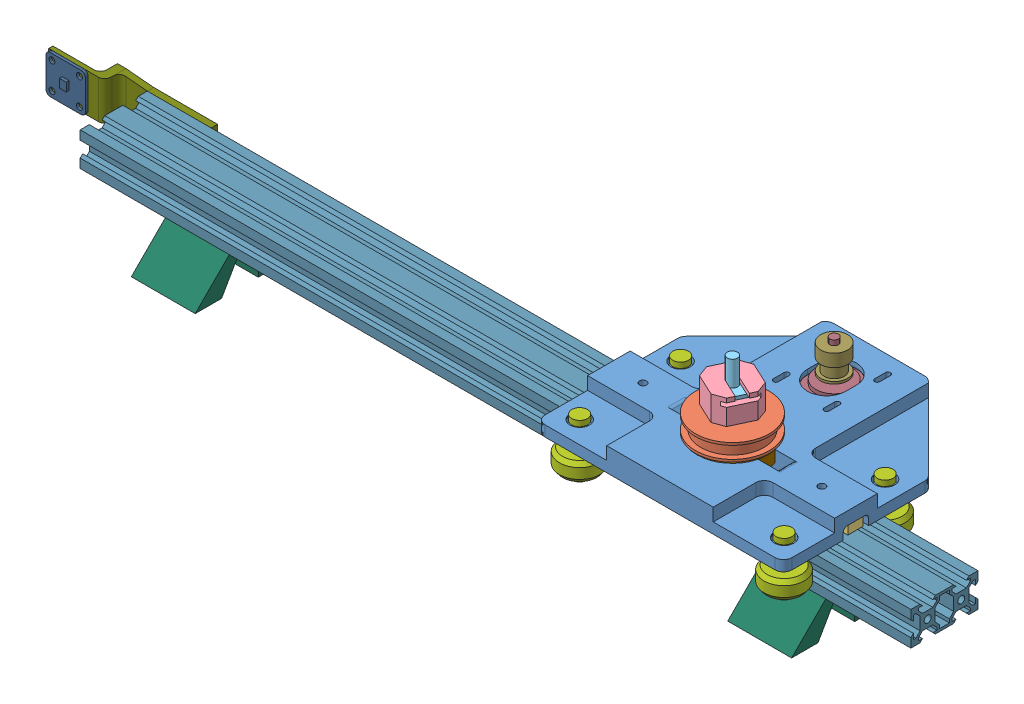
SolidWorks assembly Total Assembly.SLDASM, configuration Default (file format 15000). Lengths in mm.
Overall size (545.21 98.42 134.95).
24 component instances, 16 part files, 12 mates.
Components (placement in the parent):
- Camera Mount Assembly-1: Camera Mount Assembly.SLDASM [Default] at (442.5309 13.081 -43.18) x (-1 0 0) z (0 0 -1) size (155.86 84.23 134.95)
  - Camera Adapter w Bearings-1: Camera Adapter w Bearings.SLDPRT [Default] at origin size (147.32 13.97 130.81)
  - Big Pully-1: Big Pully.SLDPRT [Default] at (73.66 25.4 -43.18) x (-0.462019 0 -0.88687) z (-0.88687 0 0.462019) size (43.94 16.13 43.94)
  - Timing Belt Holder-1: Timing Belt Holder.SLDPRT [Default] at (20.32 6.35 -43.18) x (1 0 0) z (0 0 -1) size (40 5.33 9.04)
  - Timing Belt Holder-2: Timing Belt Holder.SLDPRT [Default] at (127 6.35 -43.18) x (1 0 0) z (0 0 -1) size (40 5.33 9.04)
  - Camera to Shaft Adapter-1: Camera to Shaft Adapter.SLDPRT [Glue] at (73.66 40.108 -43.18) x (0.422131 0 -0.906535) z (-0.906535 0 -0.422131) size (24.38 14.73 24.38)
  - Camera Screw-1: Camera Screw.SLDPRT [Default] at (73.66 38.203 -43.18) x (-0.422131 0 0.906535) z (-0.906535 0 -0.422131) size (18.03 16.81 18.03)
  - Shaft-1: Shaft.SLDPRT [Default] at (73.66 38.203 -43.18) x (0.883617 0 -0.468211) z (-0.468211 0 -0.883617) size (7.95 30.48 7.95)
  - Bearings-1: Bearings.SLDPRT [Default] at (134.62 9.1948 -13.1064) x (0.724268 0 0.689518) z (-0.689518 0 0.724268) size (24 32.44 24)
  - Bearings-2: Bearings.SLDPRT [Default] at (12.7 9.1948 -13.1064) x (0.724268 0 0.689518) z (-0.689518 0 0.724268) size (24 32.44 24)
  - Bearings-3: Bearings.SLDPRT [Default] at (134.62 9.1948 -73.3044) x (0.724268 0 0.689518) z (-0.689518 0 0.724268) size (24 32.44 24)
  - Bearings-4: Bearings.SLDPRT [Default] at (12.7 9.1948 -73.3044) x (0.724268 0 0.689518) z (-0.689518 0 0.724268) size (24 32.44 24)
  - Big Pully Adapter-1: Big Pully Adapter.SLDPRT [Default] at (73.66 7.366 -43.18) x (-0.046219 0 -0.998931) z (0.998931 0 -0.046219) size (33.02 7.87 33.02)
  - Shaft Bearing-1: Shaft Bearing.SLDPRT [Default] at (73.66 10.4775 -43.18) x (0.99903 0 -0.044037) z (0.044037 0 0.99903) size (42.01 6.99 42.01)
  - Encoder Chip-1: Encoder Chip.SLDPRT [Default] at (73.66 1.905 -43.18) x (-1 0 0) z (0 0 -1) size (23.49 3.3 22.86)
  - Magnet-1: Magnet.SLDPRT [Default] at (73.66 6.707 -43.18) x (0.998847 0 -0.048009) z (0.048009 0 0.998847) size (3.99 1.02 3.99)
  - Small Pully-1: Small Pully.SLDPRT [Default] at (73.66 31.3055 17.5037) x (0.522691 0 0.852522) z (0 1 0) size (16 16 16)
  - Stepper Motor-1: Stepper Motor.SLDPRT [Default] at (73.66 -29.21 17.5037) size (42.16 63.5 48.26)
- Feet Assembly-1: Feet Assembly.SLDASM [Default] at origin size (495.3 40.32 80.64)
  - 2040 Extrusion-1: 2040 Extrusion.SLDPRT [Default] at origin size (495.3 20 40)
  - Feet-1: Feet.SLDPRT [Default] at (406.4 -11.905 0) size (38.1 20.32 80.64)
  - Feet-2: Feet.SLDPRT [Default] at (50.8 -11.905 0) size (38.1 20.32 80.64)
- Rotary Encoder Mount-1: Rotary Encoder Mount.SLDPRT [Default] at (38.1 10 -21.905) x (-1 0 0) z (0 1 0) size (88.01 12.7 22.99)
- Encoder Chip-1: Encoder Chip.SLDPRT [Default] at (-38.1478 0.0508 -11.11) x (1 0 0) z (0 -1 0) size (23.49 3.3 22.86)
Mates (geometry in assembly coordinates):
- Coincident1: coincident aligned: plane of Feet Assembly-1 through (0 0 0) normal (0 0 1)
- Coincident2: coincident aligned: plane of Feet Assembly-1 through (0 0 0) normal (0 1 0)
- Coincident3: coincident aligned: plane of Feet Assembly-1 through (0 0 0) normal (1 0 0)
- Width1: width anti-aligned: plane of Camera Mount Assembly-1/Timing Belt Holder-2 through (335.5334 14.097 4.5212) normal (0 0 1); plane of Feet Assembly-1/2040 Extrusion-1 through (335.5334 14.097 -4.5212) normal (0 0 -1); plane of Camera Mount Assembly-1/Timing Belt Holder-2 through (495.3 0 -20) normal (0 0 -1); plane of Feet Assembly-1/2040 Extrusion-1 through (495.3 0 20) normal (0 0 1)
- Width2: width aligned: plane of Camera Mount Assembly-1/Bearings-1 through (304.4607 5.461 -26.4495) normal (0 1 0); plane of Feet Assembly-1/2040 Extrusion-1 through (300.9054 -5.461 -22.715) normal (0 -1 0); plane of Camera Mount Assembly-1/Bearings-1 through (495.3 10 0) normal (0 1 0); plane of Feet Assembly-1/2040 Extrusion-1 through (495.3 -10 0) normal (0 -1 0)
- Coincident4: coincident anti-aligned: plane of Feet Assembly-1/2040 Extrusion-1 through (495.3 0 -20) normal (0 0 -1); plane of Rotary Encoder Mount-1 through (0 10 -20) normal (0 0 1)
- Parallel1: parallel aligned: plane of Feet Assembly-1/2040 Extrusion-1 through (0 0 0) normal (-1 0 0); plane of Rotary Encoder Mount-1 through (-49.911 11.4935 -13.65) normal (-1 0 0)
- Width3: width anti-aligned: plane of Feet Assembly-1/2040 Extrusion-1 through (495.3 10 0) normal (0 1 0); plane of Rotary Encoder Mount-1 through (495.3 -10 0) normal (0 -1 0); plane of Feet Assembly-1/2040 Extrusion-1 through (0 -10 -20) normal (0 -1 0); plane of Rotary Encoder Mount-1 through (0 10 -20) normal (0 1 0)
- Coincident5: coincident anti-aligned: line of Feet Assembly-1/2040 Extrusion-1 through (0 10 -20) axis (0 0 1); line of Rotary Encoder Mount-1 through (0 10 -20) axis (0 0 -1)
- Coincident6: coincident anti-aligned: plane of Rotary Encoder Mount-1 through (38.1 10 -11.11) normal (0 0 1); plane of Encoder Chip-1 through (-38.1478 0.0508 -11.11) normal (0 0 -1)
- Concentric1: concentric aligned: cylinder of Rotary Encoder Mount-1 through (-29.9563 7.9248 -13.65) axis (0 0 1) radius 1.7907; cylinder of Encoder Chip-1 through (-29.9563 7.9248 -11.11) axis (0 0 1) radius 1.778
- Parallel2: parallel aligned: cylinder of Rotary Encoder Mount-1 through (-46.2437 -7.9248 -13.65) axis (0 0 1) radius 1.7907; cylinder of Encoder Chip-1 through (-46.3393 -7.8232 -11.11) axis (0 0 1) radius 1.778
